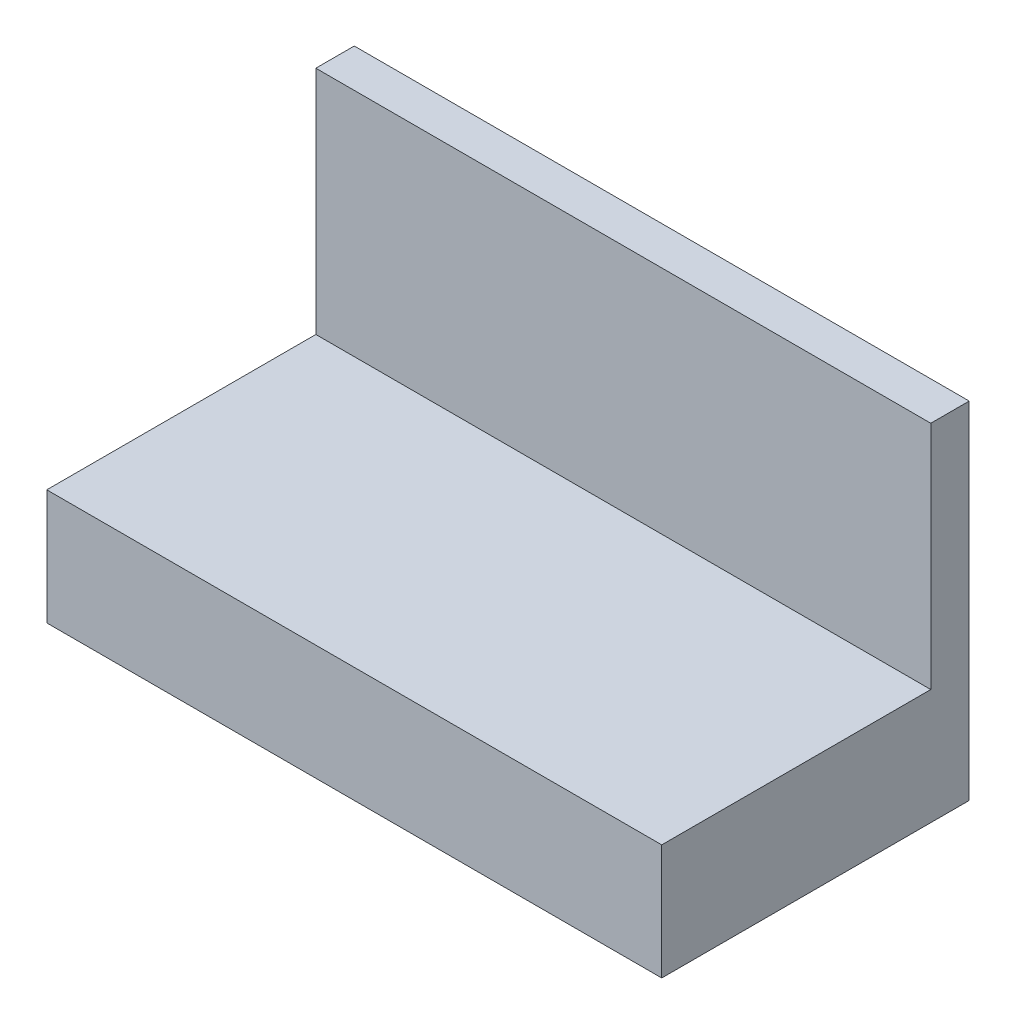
from build123d import *

# Parameters (mm, degrees)
EXTRUSION1_DEPTH        = 16
ESQUISSE3_W             = 14
ESQUISSE3_H             = 6
ENL_V_MAT_EXTRU_1_DEPTH = 2
ESQUISSE4_R             = 1.5
ESQUISSE4_R_2           = 1
EXTRUSION2_DEPTH        = 2


with BuildPart() as part:
    # Esquisse2 → Extrusion1 (new body)
    with BuildSketch(Plane(origin=(0, 0, 0), x_dir=(0, 0, -1), z_dir=(1, 0, 0))):
        Polygon((0, 0), (0, 3), (1, 3), (7, 3), (7, 9), (8, 9), (8, 2.44484777), (8, 0), align=None)
    extrude(amount=-EXTRUSION1_DEPTH)

    # Esquisse3 → Enl_v. mat.-Extru.1 (cut)
    with BuildSketch(Plane.XZ):
        with Locations((-8, -4)):
            Rectangle(ESQUISSE3_W, ESQUISSE3_H)
    extrude(amount=-ENL_V_MAT_EXTRU_1_DEPTH, mode=Mode.SUBTRACT)

    # Esquisse4 → Extrusion2 (add)
    with BuildSketch(Plane.XZ.offset(-2)):
        with Locations(Location((-8, -4, 0), (0, 0, 90))):
            Circle(ESQUISSE4_R)
        with Locations(Location((-8, -4, 0), (0, 0, 270))):
            Circle(ESQUISSE4_R_2, mode=Mode.SUBTRACT)
    extrude(amount=EXTRUSION2_DEPTH)


solid = part.part
